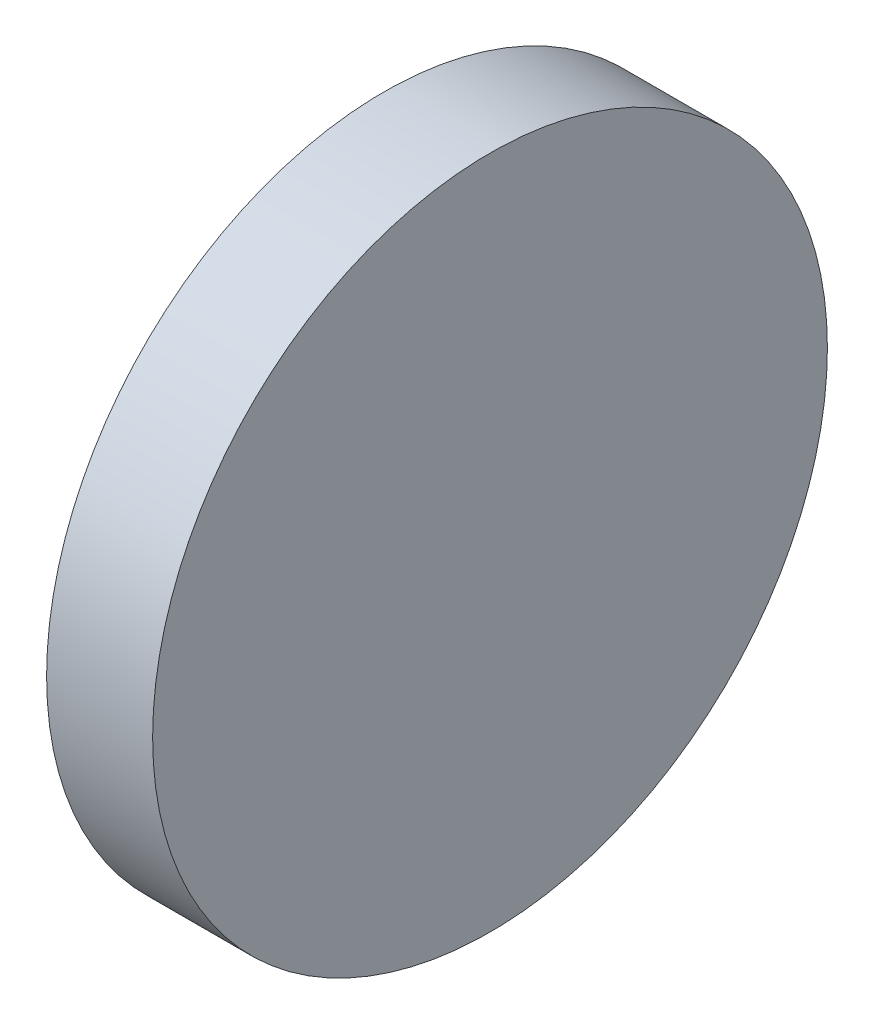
ISO-10303-21;
HEADER;
FILE_DESCRIPTION(('STEP AP214'),'2;1');
FILE_NAME('part.step','',(''),(''),'','','');
FILE_SCHEMA(('AUTOMOTIVE_DESIGN { 1 0 10303 214 1 1 1 1 }'));
ENDSEC;
DATA;
#1=APPLICATION_CONTEXT('core data for automotive mechanical design processes');
#2=APPLICATION_PROTOCOL_DEFINITION('international standard','automotive_design',2000,#1);
#3=PRODUCT_CONTEXT('',#1,'mechanical');
#4=PRODUCT('Part','Part','',(#3));
#5=PRODUCT_RELATED_PRODUCT_CATEGORY('part','',(#4));
#6=PRODUCT_DEFINITION_FORMATION('','',#4);
#7=PRODUCT_DEFINITION_CONTEXT('part definition',#1,'design');
#8=PRODUCT_DEFINITION('design','',#6,#7);
#9=PRODUCT_DEFINITION_SHAPE('','',#8);
#10=(LENGTH_UNIT() NAMED_UNIT(*) SI_UNIT(.MILLI.,.METRE.));
#11=(NAMED_UNIT(*) PLANE_ANGLE_UNIT() SI_UNIT($,.RADIAN.));
#12=(NAMED_UNIT(*) SI_UNIT($,.STERADIAN.) SOLID_ANGLE_UNIT());
#13=UNCERTAINTY_MEASURE_WITH_UNIT(LENGTH_MEASURE(1.E-05),#10,'distance_accuracy_value','');
#14=(GEOMETRIC_REPRESENTATION_CONTEXT(3) GLOBAL_UNCERTAINTY_ASSIGNED_CONTEXT((#13)) GLOBAL_UNIT_ASSIGNED_CONTEXT((#10,
#11,#12)) REPRESENTATION_CONTEXT('',''));
#15=CARTESIAN_POINT('',(0.,0.,0.));
#16=DIRECTION('',(0.,0.,1.));
#17=DIRECTION('',(1.,0.,0.));
#18=AXIS2_PLACEMENT_3D('',#15,#16,#17);
#19=CARTESIAN_POINT('',(2.794,0.,0.));
#20=DIRECTION('',(-1.,0.,0.));
#21=DIRECTION('',(0.,0.,1.));
#22=AXIS2_PLACEMENT_3D('',#19,#20,#21);
#23=CYLINDRICAL_SURFACE('',#22,8.89);
#24=CARTESIAN_POINT('',(2.794,0.,0.));
#25=DIRECTION('',(1.,0.,0.));
#26=DIRECTION('',(0.,0.,-1.));
#27=AXIS2_PLACEMENT_3D('',#24,#25,#26);
#28=CIRCLE('',#27,8.89);
#29=CARTESIAN_POINT('',(2.794,0.,-8.89));
#30=VERTEX_POINT('',#29);
#31=EDGE_CURVE('E10',#30,#30,#28,.T.);
#32=ORIENTED_EDGE('',*,*,#31,.F.);
#33=EDGE_LOOP('',(#32));
#34=FACE_BOUND('',#33,.T.);
#35=CARTESIAN_POINT('',(0.,0.,0.));
#36=DIRECTION('',(1.,0.,0.));
#37=DIRECTION('',(0.,0.,-1.));
#38=AXIS2_PLACEMENT_3D('',#35,#36,#37);
#39=CIRCLE('',#38,8.89);
#40=CARTESIAN_POINT('',(0.,0.,-8.89));
#41=VERTEX_POINT('',#40);
#42=EDGE_CURVE('E42',#41,#41,#39,.T.);
#43=ORIENTED_EDGE('',*,*,#42,.T.);
#44=EDGE_LOOP('',(#43));
#45=FACE_BOUND('',#44,.T.);
#46=ADVANCED_FACE('F41',(#34,#45),#23,.T.);
#47=CARTESIAN_POINT('',(2.794,0.,0.));
#48=DIRECTION('',(1.,0.,0.));
#49=DIRECTION('',(0.,0.,-1.));
#50=AXIS2_PLACEMENT_3D('',#47,#48,#49);
#51=PLANE('',#50);
#52=ORIENTED_EDGE('',*,*,#31,.T.);
#53=EDGE_LOOP('',(#52));
#54=FACE_BOUND('',#53,.T.);
#55=ADVANCED_FACE('F58',(#54),#51,.T.);
#56=CARTESIAN_POINT('',(0.,0.,0.));
#57=DIRECTION('',(1.,0.,0.));
#58=DIRECTION('',(0.,0.,-1.));
#59=AXIS2_PLACEMENT_3D('',#56,#57,#58);
#60=PLANE('',#59);
#61=ORIENTED_EDGE('',*,*,#42,.F.);
#62=EDGE_LOOP('',(#61));
#63=FACE_BOUND('',#62,.T.);
#64=ADVANCED_FACE('F59',(#63),#60,.F.);
#65=CLOSED_SHELL('',(#46,#55,#64));
#66=MANIFOLD_SOLID_BREP('B2',#65);
#67=ADVANCED_BREP_SHAPE_REPRESENTATION('',(#18,#66),#14);
#68=SHAPE_DEFINITION_REPRESENTATION(#9,#67);
ENDSEC;
END-ISO-10303-21;
